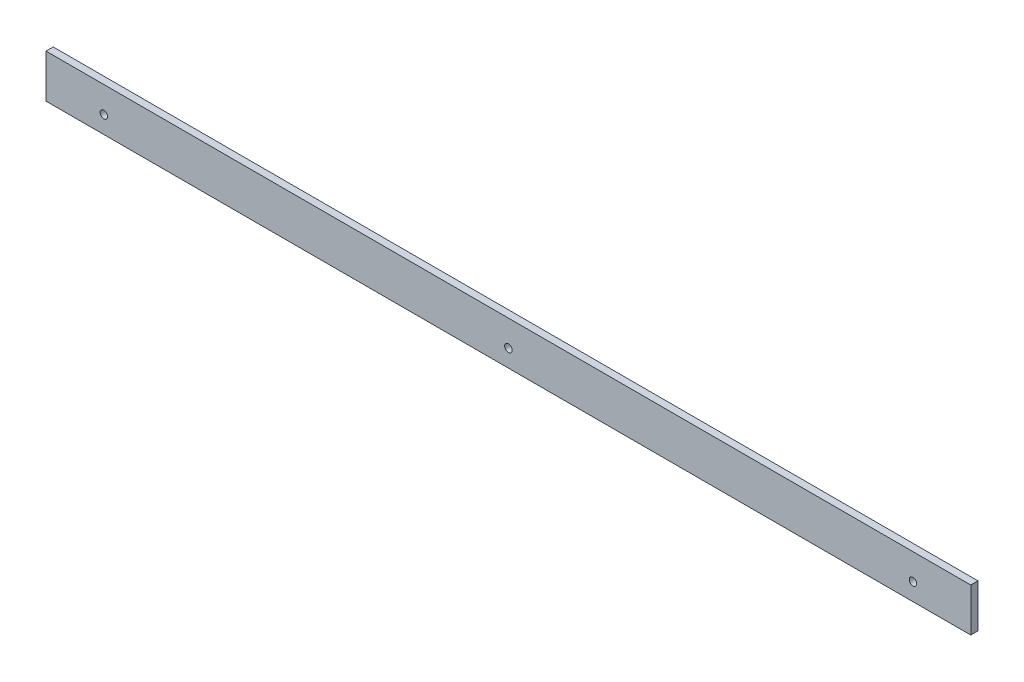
from build123d import *

# Parameters (mm, degrees)
SKETCH1_W             = 406.4
SKETCH1_H             = 19.05
BOSS_EXTRUDE1_DEPTH   = 3.175
F_4_CLEARANCE_HOLE1_D = 3.2639


with BuildPart() as part:
    # Sketch1 → Boss-Extrude1 (new body)
    with BuildSketch(Plane.XY):
        Rectangle(SKETCH1_W, SKETCH1_H)
    extrude(amount=BOSS_EXTRUDE1_DEPTH)

    # 4 Clearance Hole1 (through all)
    with Locations(Plane.XY.offset(3.175)):
        with Locations((-177.8, -1.905), (0, -1.905), (177.8, -1.905)):
            Hole(F_4_CLEARANCE_HOLE1_D / 2)


solid = part.part
